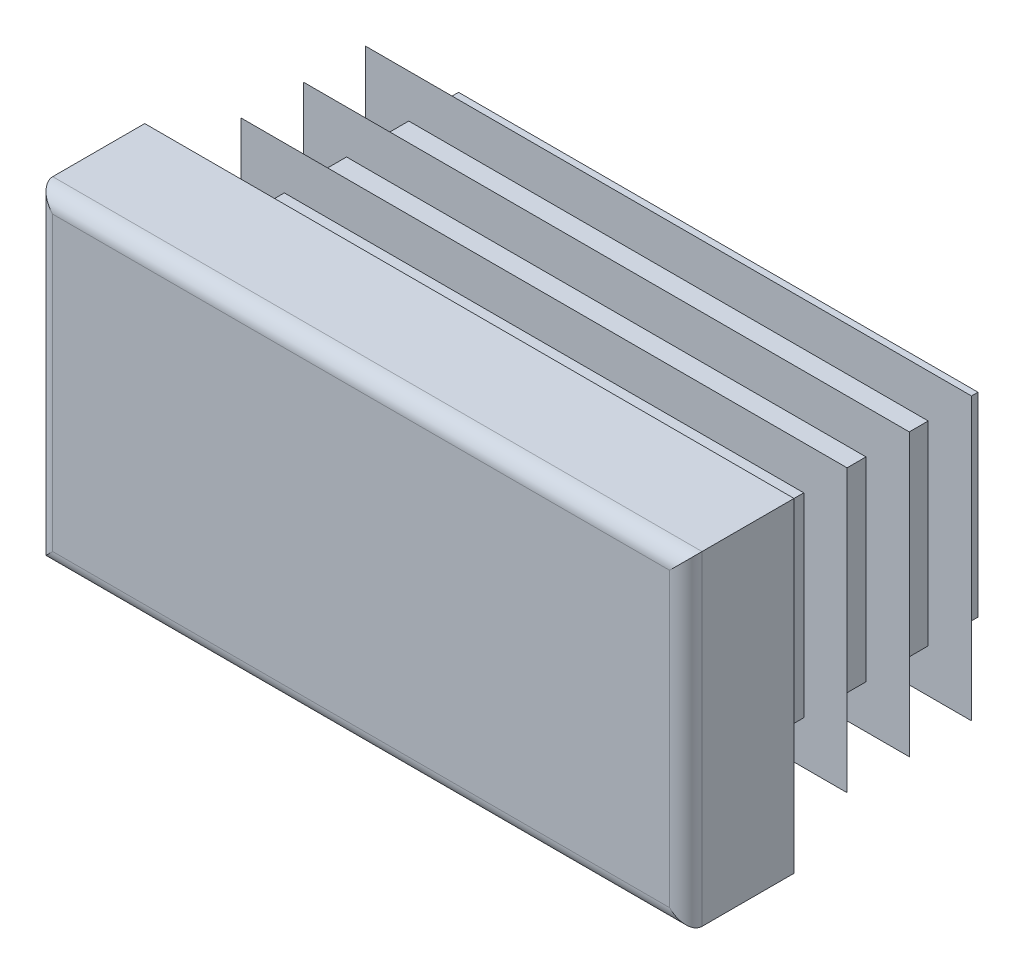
ISO-10303-21;
HEADER;
FILE_DESCRIPTION(('STEP AP214'),'2;1');
FILE_NAME('part.step','',(''),(''),'','','');
FILE_SCHEMA(('AUTOMOTIVE_DESIGN { 1 0 10303 214 1 1 1 1 }'));
ENDSEC;
DATA;
#1=APPLICATION_CONTEXT('core data for automotive mechanical design processes');
#2=APPLICATION_PROTOCOL_DEFINITION('international standard','automotive_design',2000,#1);
#3=PRODUCT_CONTEXT('',#1,'mechanical');
#4=PRODUCT('Part','Part','',(#3));
#5=PRODUCT_RELATED_PRODUCT_CATEGORY('part','',(#4));
#6=PRODUCT_DEFINITION_FORMATION('','',#4);
#7=PRODUCT_DEFINITION_CONTEXT('part definition',#1,'design');
#8=PRODUCT_DEFINITION('design','',#6,#7);
#9=PRODUCT_DEFINITION_SHAPE('','',#8);
#10=(LENGTH_UNIT() NAMED_UNIT(*) SI_UNIT(.MILLI.,.METRE.));
#11=(NAMED_UNIT(*) PLANE_ANGLE_UNIT() SI_UNIT($,.RADIAN.));
#12=(NAMED_UNIT(*) SI_UNIT($,.STERADIAN.) SOLID_ANGLE_UNIT());
#13=UNCERTAINTY_MEASURE_WITH_UNIT(LENGTH_MEASURE(1.E-05),#10,'distance_accuracy_value','');
#14=(GEOMETRIC_REPRESENTATION_CONTEXT(3) GLOBAL_UNCERTAINTY_ASSIGNED_CONTEXT((#13)) GLOBAL_UNIT_ASSIGNED_CONTEXT((#10,
#11,#12)) REPRESENTATION_CONTEXT('',''));
#15=CARTESIAN_POINT('',(0.,0.,0.));
#16=DIRECTION('',(0.,0.,1.));
#17=DIRECTION('',(1.,0.,0.));
#18=AXIS2_PLACEMENT_3D('',#15,#16,#17);
#19=CARTESIAN_POINT('',(14.25,-7.5,5.));
#20=DIRECTION('',(0.,0.,-1.));
#21=DIRECTION('',(0.,1.,0.));
#22=AXIS2_PLACEMENT_3D('',#19,#20,#21);
#23=PLANE('',#22);
#24=DIRECTION('',(0.,1.,0.));
#25=VECTOR('',#24,1.);
#26=CARTESIAN_POINT('',(-14.25,-7.5,5.));
#27=LINE('',#26,#25);
#28=CARTESIAN_POINT('',(-14.25,-6.75,5.));
#29=VERTEX_POINT('',#28);
#30=CARTESIAN_POINT('',(-14.25,6.75,5.));
#31=VERTEX_POINT('',#30);
#32=EDGE_CURVE('E310',#29,#31,#27,.T.);
#33=ORIENTED_EDGE('',*,*,#32,.F.);
#34=DIRECTION('',(-1.,0.,0.));
#35=VECTOR('',#34,1.);
#36=CARTESIAN_POINT('',(15.,-6.75,5.));
#37=LINE('',#36,#35);
#38=CARTESIAN_POINT('',(14.25,-6.75,5.));
#39=VERTEX_POINT('',#38);
#40=EDGE_CURVE('E482',#39,#29,#37,.T.);
#41=ORIENTED_EDGE('',*,*,#40,.F.);
#42=DIRECTION('',(0.,1.,0.));
#43=VECTOR('',#42,1.);
#44=CARTESIAN_POINT('',(14.25,-7.5,5.));
#45=LINE('',#44,#43);
#46=CARTESIAN_POINT('',(14.25,6.75,5.));
#47=VERTEX_POINT('',#46);
#48=EDGE_CURVE('E305',#39,#47,#45,.T.);
#49=ORIENTED_EDGE('',*,*,#48,.T.);
#50=DIRECTION('',(-1.,0.,0.));
#51=VECTOR('',#50,1.);
#52=CARTESIAN_POINT('',(15.,6.75,5.));
#53=LINE('',#52,#51);
#54=EDGE_CURVE('E630',#47,#31,#53,.T.);
#55=ORIENTED_EDGE('',*,*,#54,.T.);
#56=EDGE_LOOP('',(#33,#41,#49,#55));
#57=FACE_BOUND('',#56,.T.);
#58=ADVANCED_FACE('F14',(#57),#23,.F.);
#59=CARTESIAN_POINT('',(-14.25,-7.5,4.25));
#60=DIRECTION('',(0.,1.,0.));
#61=DIRECTION('',(-1.,0.,0.));
#62=AXIS2_PLACEMENT_3D('',#59,#60,#61);
#63=CYLINDRICAL_SURFACE('',#62,0.75);
#64=DIRECTION('',(0.,1.,0.));
#65=VECTOR('',#64,1.);
#66=CARTESIAN_POINT('',(-15.,-7.5,4.25));
#67=LINE('',#66,#65);
#68=CARTESIAN_POINT('',(-15.,-7.5,4.25));
#69=VERTEX_POINT('',#68);
#70=CARTESIAN_POINT('',(-15.,7.5,4.25));
#71=VERTEX_POINT('',#70);
#72=EDGE_CURVE('E402',#69,#71,#67,.T.);
#73=ORIENTED_EDGE('',*,*,#72,.F.);
#74=CARTESIAN_POINT('',(-14.25,-6.75,4.25));
#75=DIRECTION('',(-0.707106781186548,0.707106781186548,0.));
#76=DIRECTION('',(0.707106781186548,0.707106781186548,0.));
#77=AXIS2_PLACEMENT_3D('',#74,#75,#76);
#78=ELLIPSE('',#77,1.06066017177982,0.75);
#79=EDGE_CURVE('E59',#69,#29,#78,.T.);
#80=ORIENTED_EDGE('',*,*,#79,.T.);
#81=ORIENTED_EDGE('',*,*,#32,.T.);
#82=CARTESIAN_POINT('',(-14.25,6.75,4.25));
#83=DIRECTION('',(0.707106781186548,0.707106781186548,0.));
#84=DIRECTION('',(-0.707106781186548,0.707106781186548,0.));
#85=AXIS2_PLACEMENT_3D('',#82,#83,#84);
#86=ELLIPSE('',#85,1.06066017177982,0.75);
#87=EDGE_CURVE('E306',#31,#71,#86,.F.);
#88=ORIENTED_EDGE('',*,*,#87,.T.);
#89=EDGE_LOOP('',(#73,#80,#81,#88));
#90=FACE_BOUND('',#89,.T.);
#91=ADVANCED_FACE('F16',(#90),#63,.T.);
#92=CARTESIAN_POINT('',(-15.,-7.5,4.25));
#93=DIRECTION('',(1.,0.,0.));
#94=DIRECTION('',(0.,1.,0.));
#95=AXIS2_PLACEMENT_3D('',#92,#93,#94);
#96=PLANE('',#95);
#97=DIRECTION('',(0.,0.,-1.));
#98=VECTOR('',#97,1.);
#99=CARTESIAN_POINT('',(-15.,7.5,4.25));
#100=LINE('',#99,#98);
#101=CARTESIAN_POINT('',(-15.,7.5,0.));
#102=VERTEX_POINT('',#101);
#103=EDGE_CURVE('E615',#71,#102,#100,.T.);
#104=ORIENTED_EDGE('',*,*,#103,.T.);
#105=DIRECTION('',(0.,1.,0.));
#106=VECTOR('',#105,1.);
#107=CARTESIAN_POINT('',(-15.,-7.5,0.));
#108=LINE('',#107,#106);
#109=CARTESIAN_POINT('',(-15.,-7.5,0.));
#110=VERTEX_POINT('',#109);
#111=EDGE_CURVE('E400',#110,#102,#108,.T.);
#112=ORIENTED_EDGE('',*,*,#111,.F.);
#113=DIRECTION('',(0.,0.,-1.));
#114=VECTOR('',#113,1.);
#115=CARTESIAN_POINT('',(-15.,-7.5,4.25));
#116=LINE('',#115,#114);
#117=EDGE_CURVE('E616',#69,#110,#116,.T.);
#118=ORIENTED_EDGE('',*,*,#117,.F.);
#119=ORIENTED_EDGE('',*,*,#72,.T.);
#120=EDGE_LOOP('',(#104,#112,#118,#119));
#121=FACE_BOUND('',#120,.T.);
#122=ADVANCED_FACE('F697',(#121),#96,.F.);
#123=CARTESIAN_POINT('',(-12.,-7.5,0.));
#124=DIRECTION('',(1.,0.,0.));
#125=DIRECTION('',(0.,1.,0.));
#126=AXIS2_PLACEMENT_3D('',#123,#124,#125);
#127=PLANE('',#126);
#128=DIRECTION('',(0.,1.,0.));
#129=VECTOR('',#128,1.);
#130=CARTESIAN_POINT('',(-12.,-7.5,0.));
#131=LINE('',#130,#129);
#132=CARTESIAN_POINT('',(-12.,-4.5,0.));
#133=VERTEX_POINT('',#132);
#134=CARTESIAN_POINT('',(-12.,4.5,0.));
#135=VERTEX_POINT('',#134);
#136=EDGE_CURVE('E397',#133,#135,#131,.T.);
#137=ORIENTED_EDGE('',*,*,#136,.T.);
#138=DIRECTION('',(0.,0.,-1.));
#139=VECTOR('',#138,1.);
#140=CARTESIAN_POINT('',(-12.,4.5,0.));
#141=LINE('',#140,#139);
#142=CARTESIAN_POINT('',(-12.,4.5,-0.575));
#143=VERTEX_POINT('',#142);
#144=EDGE_CURVE('E495',#135,#143,#141,.T.);
#145=ORIENTED_EDGE('',*,*,#144,.T.);
#146=DIRECTION('',(0.,1.,0.));
#147=VECTOR('',#146,1.);
#148=CARTESIAN_POINT('',(-12.,-7.5,-0.575));
#149=LINE('',#148,#147);
#150=CARTESIAN_POINT('',(-12.,-4.5,-0.575));
#151=VERTEX_POINT('',#150);
#152=EDGE_CURVE('E394',#151,#143,#149,.T.);
#153=ORIENTED_EDGE('',*,*,#152,.F.);
#154=DIRECTION('',(0.,0.,1.));
#155=VECTOR('',#154,1.);
#156=CARTESIAN_POINT('',(-12.,-4.5,0.));
#157=LINE('',#156,#155);
#158=EDGE_CURVE('E489',#151,#133,#157,.T.);
#159=ORIENTED_EDGE('',*,*,#158,.T.);
#160=EDGE_LOOP('',(#137,#145,#153,#159));
#161=FACE_BOUND('',#160,.T.);
#162=ADVANCED_FACE('F787',(#161),#127,.F.);
#163=CARTESIAN_POINT('',(-14.,-7.5,-0.575));
#164=DIRECTION('',(0.342020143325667,0.,0.939692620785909));
#165=DIRECTION('',(-0.939692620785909,0.,0.342020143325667));
#166=AXIS2_PLACEMENT_3D('',#163,#164,#165);
#167=PLANE('',#166);
#168=DIRECTION('',(0.,1.,0.));
#169=VECTOR('',#168,1.);
#170=CARTESIAN_POINT('',(-14.,-7.5,-0.575));
#171=LINE('',#170,#169);
#172=CARTESIAN_POINT('',(-14.,-6.5,-0.575));
#173=VERTEX_POINT('',#172);
#174=CARTESIAN_POINT('',(-14.,6.5,-0.575));
#175=VERTEX_POINT('',#174);
#176=EDGE_CURVE('E392',#173,#175,#171,.T.);
#177=ORIENTED_EDGE('',*,*,#176,.T.);
#178=DIRECTION('',(0.844349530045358,-0.43889572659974,-0.307318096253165));
#179=VECTOR('',#178,1.);
#180=CARTESIAN_POINT('',(-8.81186039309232,3.80318757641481,-2.46332838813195));
#181=LINE('',#180,#179);
#182=CARTESIAN_POINT('',(-12.,5.46039327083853,-1.3029404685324));
#183=VERTEX_POINT('',#182);
#184=EDGE_CURVE('E519',#175,#183,#181,.T.);
#185=ORIENTED_EDGE('',*,*,#184,.T.);
#186=DIRECTION('',(0.,1.,0.));
#187=VECTOR('',#186,1.);
#188=CARTESIAN_POINT('',(-12.,-7.5,-1.3029404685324));
#189=LINE('',#188,#187);
#190=CARTESIAN_POINT('',(-12.,-5.46039327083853,-1.3029404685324));
#191=VERTEX_POINT('',#190);
#192=EDGE_CURVE('E389',#191,#183,#189,.T.);
#193=ORIENTED_EDGE('',*,*,#192,.F.);
#194=DIRECTION('',(-0.844349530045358,-0.438895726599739,0.307318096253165));
#195=VECTOR('',#194,1.);
#196=CARTESIAN_POINT('',(-14.3705814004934,-6.69262945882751,-0.440119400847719));
#197=LINE('',#196,#195);
#198=EDGE_CURVE('E507',#191,#173,#197,.T.);
#199=ORIENTED_EDGE('',*,*,#198,.T.);
#200=EDGE_LOOP('',(#177,#185,#193,#199));
#201=FACE_BOUND('',#200,.T.);
#202=ADVANCED_FACE('F783',(#201),#167,.F.);
#203=CARTESIAN_POINT('',(-12.,-7.5,-1.3029404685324));
#204=DIRECTION('',(1.,0.,0.));
#205=DIRECTION('',(0.,1.,0.));
#206=AXIS2_PLACEMENT_3D('',#203,#204,#205);
#207=PLANE('',#206);
#208=ORIENTED_EDGE('',*,*,#192,.T.);
#209=DIRECTION('',(0.,-0.819152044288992,-0.573576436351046));
#210=VECTOR('',#209,1.);
#211=CARTESIAN_POINT('',(-12.,-3.23616114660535,-7.39233342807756));
#212=LINE('',#211,#210);
#213=CARTESIAN_POINT('',(-12.,4.5,-1.97541507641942));
#214=VERTEX_POINT('',#213);
#215=EDGE_CURVE('E516',#183,#214,#212,.T.);
#216=ORIENTED_EDGE('',*,*,#215,.T.);
#217=DIRECTION('',(0.,0.,-1.));
#218=VECTOR('',#217,1.);
#219=CARTESIAN_POINT('',(-12.,4.5,-1.3029404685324));
#220=LINE('',#219,#218);
#221=CARTESIAN_POINT('',(-12.,4.5,-3.45));
#222=VERTEX_POINT('',#221);
#223=EDGE_CURVE('E525',#214,#222,#220,.T.);
#224=ORIENTED_EDGE('',*,*,#223,.T.);
#225=DIRECTION('',(0.,1.,0.));
#226=VECTOR('',#225,1.);
#227=CARTESIAN_POINT('',(-12.,-7.5,-3.45));
#228=LINE('',#227,#226);
#229=CARTESIAN_POINT('',(-12.,-4.5,-3.45));
#230=VERTEX_POINT('',#229);
#231=EDGE_CURVE('E386',#230,#222,#228,.T.);
#232=ORIENTED_EDGE('',*,*,#231,.F.);
#233=DIRECTION('',(0.,0.,1.));
#234=VECTOR('',#233,1.);
#235=CARTESIAN_POINT('',(-12.,-4.5,-1.3029404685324));
#236=LINE('',#235,#234);
#237=CARTESIAN_POINT('',(-12.,-4.5,-1.97541507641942));
#238=VERTEX_POINT('',#237);
#239=EDGE_CURVE('E522',#230,#238,#236,.T.);
#240=ORIENTED_EDGE('',*,*,#239,.T.);
#241=DIRECTION('',(0.,-0.819152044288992,0.573576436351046));
#242=VECTOR('',#241,1.);
#243=CARTESIAN_POINT('',(-12.,-6.82898992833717,-0.344638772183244));
#244=LINE('',#243,#242);
#245=EDGE_CURVE('E504',#238,#191,#244,.T.);
#246=ORIENTED_EDGE('',*,*,#245,.T.);
#247=EDGE_LOOP('',(#208,#216,#224,#232,#240,#246));
#248=FACE_BOUND('',#247,.T.);
#249=ADVANCED_FACE('F779',(#248),#207,.F.);
#250=CARTESIAN_POINT('',(-14.,-7.5,-3.45));
#251=DIRECTION('',(0.342020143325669,0.,0.939692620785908));
#252=DIRECTION('',(-0.939692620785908,0.,0.342020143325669));
#253=AXIS2_PLACEMENT_3D('',#250,#251,#252);
#254=PLANE('',#253);
#255=DIRECTION('',(0.,1.,0.));
#256=VECTOR('',#255,1.);
#257=CARTESIAN_POINT('',(-14.,-7.5,-3.45));
#258=LINE('',#257,#256);
#259=CARTESIAN_POINT('',(-14.,-6.5,-3.45));
#260=VERTEX_POINT('',#259);
#261=CARTESIAN_POINT('',(-14.,6.5,-3.45));
#262=VERTEX_POINT('',#261);
#263=EDGE_CURVE('E384',#260,#262,#258,.T.);
#264=ORIENTED_EDGE('',*,*,#263,.T.);
#265=DIRECTION('',(0.844349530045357,-0.438895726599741,-0.307318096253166));
#266=VECTOR('',#265,1.);
#267=CARTESIAN_POINT('',(-8.8118603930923,3.80318757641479,-5.33832838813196));
#268=LINE('',#267,#266);
#269=CARTESIAN_POINT('',(-12.,5.46039327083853,-4.1779404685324));
#270=VERTEX_POINT('',#269);
#271=EDGE_CURVE('E549',#262,#270,#268,.T.);
#272=ORIENTED_EDGE('',*,*,#271,.T.);
#273=DIRECTION('',(0.,1.,0.));
#274=VECTOR('',#273,1.);
#275=CARTESIAN_POINT('',(-12.,-7.5,-4.1779404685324));
#276=LINE('',#275,#274);
#277=CARTESIAN_POINT('',(-12.,-5.46039327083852,-4.1779404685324));
#278=VERTEX_POINT('',#277);
#279=EDGE_CURVE('E381',#278,#270,#276,.T.);
#280=ORIENTED_EDGE('',*,*,#279,.F.);
#281=DIRECTION('',(-0.844349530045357,-0.438895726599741,0.307318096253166));
#282=VECTOR('',#281,1.);
#283=CARTESIAN_POINT('',(-14.3705814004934,-6.69262945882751,-3.31511940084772));
#284=LINE('',#283,#282);
#285=EDGE_CURVE('E537',#278,#260,#284,.T.);
#286=ORIENTED_EDGE('',*,*,#285,.T.);
#287=EDGE_LOOP('',(#264,#272,#280,#286));
#288=FACE_BOUND('',#287,.T.);
#289=ADVANCED_FACE('F775',(#288),#254,.F.);
#290=CARTESIAN_POINT('',(-12.,-7.5,-4.1779404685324));
#291=DIRECTION('',(1.,0.,0.));
#292=DIRECTION('',(0.,1.,0.));
#293=AXIS2_PLACEMENT_3D('',#290,#291,#292);
#294=PLANE('',#293);
#295=ORIENTED_EDGE('',*,*,#279,.T.);
#296=DIRECTION('',(0.,-0.819152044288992,-0.573576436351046));
#297=VECTOR('',#296,1.);
#298=CARTESIAN_POINT('',(-12.,-3.23616114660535,-10.2673334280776));
#299=LINE('',#298,#297);
#300=CARTESIAN_POINT('',(-12.,4.5,-4.85041507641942));
#301=VERTEX_POINT('',#300);
#302=EDGE_CURVE('E546',#270,#301,#299,.T.);
#303=ORIENTED_EDGE('',*,*,#302,.T.);
#304=DIRECTION('',(0.,0.,-1.));
#305=VECTOR('',#304,1.);
#306=CARTESIAN_POINT('',(-12.,4.5,-4.1779404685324));
#307=LINE('',#306,#305);
#308=CARTESIAN_POINT('',(-12.,4.5,-6.325));
#309=VERTEX_POINT('',#308);
#310=EDGE_CURVE('E555',#301,#309,#307,.T.);
#311=ORIENTED_EDGE('',*,*,#310,.T.);
#312=DIRECTION('',(0.,1.,0.));
#313=VECTOR('',#312,1.);
#314=CARTESIAN_POINT('',(-12.,-7.5,-6.325));
#315=LINE('',#314,#313);
#316=CARTESIAN_POINT('',(-12.,-4.5,-6.325));
#317=VERTEX_POINT('',#316);
#318=EDGE_CURVE('E378',#317,#309,#315,.T.);
#319=ORIENTED_EDGE('',*,*,#318,.F.);
#320=DIRECTION('',(0.,0.,1.));
#321=VECTOR('',#320,1.);
#322=CARTESIAN_POINT('',(-12.,-4.5,-4.1779404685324));
#323=LINE('',#322,#321);
#324=CARTESIAN_POINT('',(-12.,-4.5,-4.85041507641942));
#325=VERTEX_POINT('',#324);
#326=EDGE_CURVE('E552',#317,#325,#323,.T.);
#327=ORIENTED_EDGE('',*,*,#326,.T.);
#328=DIRECTION('',(0.,-0.819152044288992,0.573576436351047));
#329=VECTOR('',#328,1.);
#330=CARTESIAN_POINT('',(-12.,-6.82898992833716,-3.21963877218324));
#331=LINE('',#330,#329);
#332=EDGE_CURVE('E534',#325,#278,#331,.T.);
#333=ORIENTED_EDGE('',*,*,#332,.T.);
#334=EDGE_LOOP('',(#295,#303,#311,#319,#327,#333));
#335=FACE_BOUND('',#334,.T.);
#336=ADVANCED_FACE('F771',(#335),#294,.F.);
#337=CARTESIAN_POINT('',(-14.,-7.5,-6.325));
#338=DIRECTION('',(0.342020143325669,0.,0.939692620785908));
#339=DIRECTION('',(-0.939692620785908,0.,0.342020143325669));
#340=AXIS2_PLACEMENT_3D('',#337,#338,#339);
#341=PLANE('',#340);
#342=DIRECTION('',(0.,1.,0.));
#343=VECTOR('',#342,1.);
#344=CARTESIAN_POINT('',(-14.,-7.5,-6.325));
#345=LINE('',#344,#343);
#346=CARTESIAN_POINT('',(-14.,-6.5,-6.325));
#347=VERTEX_POINT('',#346);
#348=CARTESIAN_POINT('',(-14.,6.5,-6.325));
#349=VERTEX_POINT('',#348);
#350=EDGE_CURVE('E376',#347,#349,#345,.T.);
#351=ORIENTED_EDGE('',*,*,#350,.T.);
#352=DIRECTION('',(0.844349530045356,-0.438895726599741,-0.307318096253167));
#353=VECTOR('',#352,1.);
#354=CARTESIAN_POINT('',(-8.8118603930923,3.80318757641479,-8.21332838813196));
#355=LINE('',#354,#353);
#356=CARTESIAN_POINT('',(-12.,5.46039327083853,-7.05294046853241));
#357=VERTEX_POINT('',#356);
#358=EDGE_CURVE('E579',#349,#357,#355,.T.);
#359=ORIENTED_EDGE('',*,*,#358,.T.);
#360=DIRECTION('',(0.,1.,0.));
#361=VECTOR('',#360,1.);
#362=CARTESIAN_POINT('',(-12.,-7.5,-7.05294046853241));
#363=LINE('',#362,#361);
#364=CARTESIAN_POINT('',(-12.,-5.46039327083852,-7.05294046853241));
#365=VERTEX_POINT('',#364);
#366=EDGE_CURVE('E373',#365,#357,#363,.T.);
#367=ORIENTED_EDGE('',*,*,#366,.F.);
#368=DIRECTION('',(-0.844349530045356,-0.438895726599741,0.307318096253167));
#369=VECTOR('',#368,1.);
#370=CARTESIAN_POINT('',(-14.3705814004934,-6.69262945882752,-6.19011940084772));
#371=LINE('',#370,#369);
#372=EDGE_CURVE('E567',#365,#347,#371,.T.);
#373=ORIENTED_EDGE('',*,*,#372,.T.);
#374=EDGE_LOOP('',(#351,#359,#367,#373));
#375=FACE_BOUND('',#374,.T.);
#376=ADVANCED_FACE('F767',(#375),#341,.F.);
#377=CARTESIAN_POINT('',(-12.,-7.5,-7.05294046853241));
#378=DIRECTION('',(1.,0.,0.));
#379=DIRECTION('',(0.,1.,0.));
#380=AXIS2_PLACEMENT_3D('',#377,#378,#379);
#381=PLANE('',#380);
#382=ORIENTED_EDGE('',*,*,#366,.T.);
#383=DIRECTION('',(0.,-0.819152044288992,-0.573576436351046));
#384=VECTOR('',#383,1.);
#385=CARTESIAN_POINT('',(-12.,-3.23616114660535,-13.1423334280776));
#386=LINE('',#385,#384);
#387=CARTESIAN_POINT('',(-12.,4.5,-7.72541507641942));
#388=VERTEX_POINT('',#387);
#389=EDGE_CURVE('E576',#357,#388,#386,.T.);
#390=ORIENTED_EDGE('',*,*,#389,.T.);
#391=DIRECTION('',(0.,0.,-1.));
#392=VECTOR('',#391,1.);
#393=CARTESIAN_POINT('',(-12.,4.5,-7.05294046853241));
#394=LINE('',#393,#392);
#395=CARTESIAN_POINT('',(-12.,4.5,-9.2));
#396=VERTEX_POINT('',#395);
#397=EDGE_CURVE('E585',#388,#396,#394,.T.);
#398=ORIENTED_EDGE('',*,*,#397,.T.);
#399=DIRECTION('',(0.,1.,0.));
#400=VECTOR('',#399,1.);
#401=CARTESIAN_POINT('',(-12.,-7.5,-9.2));
#402=LINE('',#401,#400);
#403=CARTESIAN_POINT('',(-12.,-4.5,-9.2));
#404=VERTEX_POINT('',#403);
#405=EDGE_CURVE('E370',#404,#396,#402,.T.);
#406=ORIENTED_EDGE('',*,*,#405,.F.);
#407=DIRECTION('',(0.,0.,1.));
#408=VECTOR('',#407,1.);
#409=CARTESIAN_POINT('',(-12.,-4.5,-7.05294046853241));
#410=LINE('',#409,#408);
#411=CARTESIAN_POINT('',(-12.,-4.5,-7.72541507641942));
#412=VERTEX_POINT('',#411);
#413=EDGE_CURVE('E582',#404,#412,#410,.T.);
#414=ORIENTED_EDGE('',*,*,#413,.T.);
#415=DIRECTION('',(0.,-0.819152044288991,0.573576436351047));
#416=VECTOR('',#415,1.);
#417=CARTESIAN_POINT('',(-12.,-6.82898992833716,-6.09463877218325));
#418=LINE('',#417,#416);
#419=EDGE_CURVE('E564',#412,#365,#418,.T.);
#420=ORIENTED_EDGE('',*,*,#419,.T.);
#421=EDGE_LOOP('',(#382,#390,#398,#406,#414,#420));
#422=FACE_BOUND('',#421,.T.);
#423=ADVANCED_FACE('F764',(#422),#381,.F.);
#424=CARTESIAN_POINT('',(-14.,-7.5,-9.2));
#425=DIRECTION('',(0.342020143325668,0.,0.939692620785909));
#426=DIRECTION('',(-0.939692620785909,0.,0.342020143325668));
#427=AXIS2_PLACEMENT_3D('',#424,#425,#426);
#428=PLANE('',#427);
#429=DIRECTION('',(0.,1.,0.));
#430=VECTOR('',#429,1.);
#431=CARTESIAN_POINT('',(-14.,-7.5,-9.2));
#432=LINE('',#431,#430);
#433=CARTESIAN_POINT('',(-14.,-6.5,-9.2));
#434=VERTEX_POINT('',#433);
#435=CARTESIAN_POINT('',(-14.,6.5,-9.2));
#436=VERTEX_POINT('',#435);
#437=EDGE_CURVE('E368',#434,#436,#432,.T.);
#438=ORIENTED_EDGE('',*,*,#437,.T.);
#439=DIRECTION('',(0.844349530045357,-0.43889572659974,-0.307318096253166));
#440=VECTOR('',#439,1.);
#441=CARTESIAN_POINT('',(-8.81186039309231,3.8031875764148,-11.0883283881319));
#442=LINE('',#441,#440);
#443=CARTESIAN_POINT('',(-12.,5.46039327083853,-9.9279404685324));
#444=VERTEX_POINT('',#443);
#445=EDGE_CURVE('E607',#436,#444,#442,.T.);
#446=ORIENTED_EDGE('',*,*,#445,.T.);
#447=DIRECTION('',(0.,1.,0.));
#448=VECTOR('',#447,1.);
#449=CARTESIAN_POINT('',(-12.,-7.5,-9.9279404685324));
#450=LINE('',#449,#448);
#451=CARTESIAN_POINT('',(-12.,-5.46039327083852,-9.9279404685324));
#452=VERTEX_POINT('',#451);
#453=EDGE_CURVE('E365',#452,#444,#450,.T.);
#454=ORIENTED_EDGE('',*,*,#453,.F.);
#455=DIRECTION('',(-0.844349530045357,-0.438895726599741,0.307318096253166));
#456=VECTOR('',#455,1.);
#457=CARTESIAN_POINT('',(-14.3705814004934,-6.69262945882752,-9.06511940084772));
#458=LINE('',#457,#456);
#459=EDGE_CURVE('E595',#452,#434,#458,.T.);
#460=ORIENTED_EDGE('',*,*,#459,.T.);
#461=EDGE_LOOP('',(#438,#446,#454,#460));
#462=FACE_BOUND('',#461,.T.);
#463=ADVANCED_FACE('F675',(#462),#428,.F.);
#464=CARTESIAN_POINT('',(-12.,-7.5,-9.9279404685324));
#465=DIRECTION('',(1.,0.,0.));
#466=DIRECTION('',(0.,1.,0.));
#467=AXIS2_PLACEMENT_3D('',#464,#465,#466);
#468=PLANE('',#467);
#469=ORIENTED_EDGE('',*,*,#453,.T.);
#470=DIRECTION('',(0.,-0.819152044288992,-0.573576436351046));
#471=VECTOR('',#470,1.);
#472=CARTESIAN_POINT('',(-12.,-3.23616114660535,-16.0173334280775));
#473=LINE('',#472,#471);
#474=CARTESIAN_POINT('',(-12.,4.5,-10.6004150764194));
#475=VERTEX_POINT('',#474);
#476=EDGE_CURVE('E604',#444,#475,#473,.T.);
#477=ORIENTED_EDGE('',*,*,#476,.T.);
#478=DIRECTION('',(0.,0.,-1.));
#479=VECTOR('',#478,1.);
#480=CARTESIAN_POINT('',(-12.,4.5,-9.9279404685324));
#481=LINE('',#480,#479);
#482=CARTESIAN_POINT('',(-12.,4.5,-11.5));
#483=VERTEX_POINT('',#482);
#484=EDGE_CURVE('E613',#475,#483,#481,.T.);
#485=ORIENTED_EDGE('',*,*,#484,.T.);
#486=DIRECTION('',(0.,1.,0.));
#487=VECTOR('',#486,1.);
#488=CARTESIAN_POINT('',(-12.,-7.5,-11.5));
#489=LINE('',#488,#487);
#490=CARTESIAN_POINT('',(-12.,-4.5,-11.5));
#491=VERTEX_POINT('',#490);
#492=EDGE_CURVE('E362',#491,#483,#489,.T.);
#493=ORIENTED_EDGE('',*,*,#492,.F.);
#494=DIRECTION('',(0.,0.,1.));
#495=VECTOR('',#494,1.);
#496=CARTESIAN_POINT('',(-12.,-4.5,-9.9279404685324));
#497=LINE('',#496,#495);
#498=CARTESIAN_POINT('',(-12.,-4.5,-10.6004150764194));
#499=VERTEX_POINT('',#498);
#500=EDGE_CURVE('E610',#491,#499,#497,.T.);
#501=ORIENTED_EDGE('',*,*,#500,.T.);
#502=DIRECTION('',(0.,-0.819152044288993,0.573576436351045));
#503=VECTOR('',#502,1.);
#504=CARTESIAN_POINT('',(-12.,-6.82898992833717,-8.96963877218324));
#505=LINE('',#504,#503);
#506=EDGE_CURVE('E592',#499,#452,#505,.T.);
#507=ORIENTED_EDGE('',*,*,#506,.T.);
#508=EDGE_LOOP('',(#469,#477,#485,#493,#501,#507));
#509=FACE_BOUND('',#508,.T.);
#510=ADVANCED_FACE('F677',(#509),#468,.F.);
#511=CARTESIAN_POINT('',(-12.,-7.5,-11.5));
#512=DIRECTION('',(0.,0.,1.));
#513=DIRECTION('',(0.,-1.,0.));
#514=AXIS2_PLACEMENT_3D('',#511,#512,#513);
#515=PLANE('',#514);
#516=ORIENTED_EDGE('',*,*,#492,.T.);
#517=DIRECTION('',(-1.,0.,0.));
#518=VECTOR('',#517,1.);
#519=CARTESIAN_POINT('',(15.,4.5,-11.5));
#520=LINE('',#519,#518);
#521=CARTESIAN_POINT('',(12.,4.5,-11.5));
#522=VERTEX_POINT('',#521);
#523=EDGE_CURVE('E438',#522,#483,#520,.T.);
#524=ORIENTED_EDGE('',*,*,#523,.F.);
#525=DIRECTION('',(0.,1.,0.));
#526=VECTOR('',#525,1.);
#527=CARTESIAN_POINT('',(12.,-7.5,-11.5));
#528=LINE('',#527,#526);
#529=CARTESIAN_POINT('',(12.,-4.5,-11.5));
#530=VERTEX_POINT('',#529);
#531=EDGE_CURVE('E359',#530,#522,#528,.T.);
#532=ORIENTED_EDGE('',*,*,#531,.F.);
#533=DIRECTION('',(-1.,0.,0.));
#534=VECTOR('',#533,1.);
#535=CARTESIAN_POINT('',(15.,-4.5,-11.5));
#536=LINE('',#535,#534);
#537=EDGE_CURVE('E436',#530,#491,#536,.T.);
#538=ORIENTED_EDGE('',*,*,#537,.T.);
#539=EDGE_LOOP('',(#516,#524,#532,#538));
#540=FACE_BOUND('',#539,.T.);
#541=ADVANCED_FACE('F435',(#540),#515,.F.);
#542=CARTESIAN_POINT('',(12.,-7.5,-11.5));
#543=DIRECTION('',(-1.,0.,0.));
#544=DIRECTION('',(0.,-1.,0.));
#545=AXIS2_PLACEMENT_3D('',#542,#543,#544);
#546=PLANE('',#545);
#547=DIRECTION('',(0.,0.,1.));
#548=VECTOR('',#547,1.);
#549=CARTESIAN_POINT('',(12.,4.5,-11.5));
#550=LINE('',#549,#548);
#551=CARTESIAN_POINT('',(12.,4.5,-10.6004150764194));
#552=VERTEX_POINT('',#551);
#553=EDGE_CURVE('E9',#522,#552,#550,.T.);
#554=ORIENTED_EDGE('',*,*,#553,.T.);
#555=DIRECTION('',(0.,0.819152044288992,0.573576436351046));
#556=VECTOR('',#555,1.);
#557=CARTESIAN_POINT('',(12.,-3.97478751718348,-16.5345251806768));
#558=LINE('',#557,#556);
#559=CARTESIAN_POINT('',(12.,5.46039327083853,-9.9279404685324));
#560=VERTEX_POINT('',#559);
#561=EDGE_CURVE('E601',#552,#560,#558,.T.);
#562=ORIENTED_EDGE('',*,*,#561,.T.);
#563=DIRECTION('',(0.,1.,0.));
#564=VECTOR('',#563,1.);
#565=CARTESIAN_POINT('',(12.,-7.5,-9.9279404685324));
#566=LINE('',#565,#564);
#567=CARTESIAN_POINT('',(12.,-5.46039327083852,-9.9279404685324));
#568=VERTEX_POINT('',#567);
#569=EDGE_CURVE('E356',#568,#560,#566,.T.);
#570=ORIENTED_EDGE('',*,*,#569,.F.);
#571=DIRECTION('',(0.,0.819152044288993,-0.573576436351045));
#572=VECTOR('',#571,1.);
#573=CARTESIAN_POINT('',(12.,-6.09036355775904,-9.48683052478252));
#574=LINE('',#573,#572);
#575=CARTESIAN_POINT('',(12.,-4.5,-10.6004150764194));
#576=VERTEX_POINT('',#575);
#577=EDGE_CURVE('E428',#568,#576,#574,.T.);
#578=ORIENTED_EDGE('',*,*,#577,.T.);
#579=DIRECTION('',(0.,0.,-1.));
#580=VECTOR('',#579,1.);
#581=CARTESIAN_POINT('',(12.,-4.5,-11.5));
#582=LINE('',#581,#580);
#583=EDGE_CURVE('E23',#576,#530,#582,.T.);
#584=ORIENTED_EDGE('',*,*,#583,.T.);
#585=ORIENTED_EDGE('',*,*,#531,.T.);
#586=EDGE_LOOP('',(#554,#562,#570,#578,#584,#585));
#587=FACE_BOUND('',#586,.T.);
#588=ADVANCED_FACE('F426',(#587),#546,.F.);
#589=CARTESIAN_POINT('',(12.,-7.5,-9.9279404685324));
#590=DIRECTION('',(-0.342020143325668,0.,0.939692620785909));
#591=DIRECTION('',(-0.939692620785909,0.,-0.342020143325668));
#592=AXIS2_PLACEMENT_3D('',#589,#590,#591);
#593=PLANE('',#592);
#594=ORIENTED_EDGE('',*,*,#569,.T.);
#595=DIRECTION('',(0.844349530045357,0.43889572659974,0.307318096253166));
#596=VECTOR('',#595,1.);
#597=CARTESIAN_POINT('',(7.19711931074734,2.96383972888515,-11.6760460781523));
#598=LINE('',#597,#596);
#599=CARTESIAN_POINT('',(14.,6.5,-9.2));
#600=VERTEX_POINT('',#599);
#601=EDGE_CURVE('E598',#560,#600,#598,.T.);
#602=ORIENTED_EDGE('',*,*,#601,.T.);
#603=DIRECTION('',(0.,1.,0.));
#604=VECTOR('',#603,1.);
#605=CARTESIAN_POINT('',(14.,-7.5,-9.2));
#606=LINE('',#605,#604);
#607=CARTESIAN_POINT('',(14.,-6.5,-9.2));
#608=VERTEX_POINT('',#607);
#609=EDGE_CURVE('E353',#608,#600,#606,.T.);
#610=ORIENTED_EDGE('',*,*,#609,.F.);
#611=DIRECTION('',(-0.844349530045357,0.438895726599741,-0.307318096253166));
#612=VECTOR('',#611,1.);
#613=CARTESIAN_POINT('',(12.7558403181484,-5.85328161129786,-9.65283709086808));
#614=LINE('',#613,#612);
#615=EDGE_CURVE('E588',#608,#568,#614,.T.);
#616=ORIENTED_EDGE('',*,*,#615,.T.);
#617=EDGE_LOOP('',(#594,#602,#610,#616));
#618=FACE_BOUND('',#617,.T.);
#619=ADVANCED_FACE('F752',(#618),#593,.F.);
#620=CARTESIAN_POINT('',(14.,-7.5,-9.2));
#621=DIRECTION('',(0.,0.,-1.));
#622=DIRECTION('',(0.,1.,0.));
#623=AXIS2_PLACEMENT_3D('',#620,#621,#622);
#624=PLANE('',#623);
#625=ORIENTED_EDGE('',*,*,#609,.T.);
#626=DIRECTION('',(-1.,0.,0.));
#627=VECTOR('',#626,1.);
#628=CARTESIAN_POINT('',(15.,6.5,-9.2));
#629=LINE('',#628,#627);
#630=EDGE_CURVE('E444',#600,#436,#629,.T.);
#631=ORIENTED_EDGE('',*,*,#630,.T.);
#632=ORIENTED_EDGE('',*,*,#437,.F.);
#633=DIRECTION('',(-1.,0.,0.));
#634=VECTOR('',#633,1.);
#635=CARTESIAN_POINT('',(15.,-6.5,-9.2));
#636=LINE('',#635,#634);
#637=EDGE_CURVE('E451',#608,#434,#636,.T.);
#638=ORIENTED_EDGE('',*,*,#637,.F.);
#639=EDGE_LOOP('',(#625,#631,#632,#638));
#640=FACE_BOUND('',#639,.T.);
#641=ORIENTED_EDGE('',*,*,#405,.T.);
#642=DIRECTION('',(-1.,0.,0.));
#643=VECTOR('',#642,1.);
#644=CARTESIAN_POINT('',(15.,4.5,-9.2));
#645=LINE('',#644,#643);
#646=CARTESIAN_POINT('',(12.,4.5,-9.2));
#647=VERTEX_POINT('',#646);
#648=EDGE_CURVE('E663',#647,#396,#645,.T.);
#649=ORIENTED_EDGE('',*,*,#648,.F.);
#650=DIRECTION('',(0.,1.,0.));
#651=VECTOR('',#650,1.);
#652=CARTESIAN_POINT('',(12.,-7.5,-9.2));
#653=LINE('',#652,#651);
#654=CARTESIAN_POINT('',(12.,-4.5,-9.2));
#655=VERTEX_POINT('',#654);
#656=EDGE_CURVE('E350',#655,#647,#653,.T.);
#657=ORIENTED_EDGE('',*,*,#656,.F.);
#658=DIRECTION('',(-1.,0.,0.));
#659=VECTOR('',#658,1.);
#660=CARTESIAN_POINT('',(15.,-4.5,-9.2));
#661=LINE('',#660,#659);
#662=EDGE_CURVE('E453',#655,#404,#661,.T.);
#663=ORIENTED_EDGE('',*,*,#662,.T.);
#664=EDGE_LOOP('',(#641,#649,#657,#663));
#665=FACE_BOUND('',#664,.T.);
#666=ADVANCED_FACE('F667',(#640,#665),#624,.F.);
#667=CARTESIAN_POINT('',(12.,-7.5,-9.2));
#668=DIRECTION('',(-1.,0.,0.));
#669=DIRECTION('',(0.,-1.,0.));
#670=AXIS2_PLACEMENT_3D('',#667,#668,#669);
#671=PLANE('',#670);
#672=DIRECTION('',(0.,0.,1.));
#673=VECTOR('',#672,1.);
#674=CARTESIAN_POINT('',(12.,4.5,-9.2));
#675=LINE('',#674,#673);
#676=CARTESIAN_POINT('',(12.,4.5,-7.72541507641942));
#677=VERTEX_POINT('',#676);
#678=EDGE_CURVE('E420',#647,#677,#675,.T.);
#679=ORIENTED_EDGE('',*,*,#678,.T.);
#680=DIRECTION('',(0.,0.819152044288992,0.573576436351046));
#681=VECTOR('',#680,1.);
#682=CARTESIAN_POINT('',(12.,-4.24494914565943,-13.8486943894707));
#683=LINE('',#682,#681);
#684=CARTESIAN_POINT('',(12.,5.46039327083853,-7.05294046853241));
#685=VERTEX_POINT('',#684);
#686=EDGE_CURVE('E573',#677,#685,#683,.T.);
#687=ORIENTED_EDGE('',*,*,#686,.T.);
#688=DIRECTION('',(0.,1.,0.));
#689=VECTOR('',#688,1.);
#690=CARTESIAN_POINT('',(12.,-7.5,-7.05294046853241));
#691=LINE('',#690,#689);
#692=CARTESIAN_POINT('',(12.,-5.46039327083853,-7.05294046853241));
#693=VERTEX_POINT('',#692);
#694=EDGE_CURVE('E347',#693,#685,#691,.T.);
#695=ORIENTED_EDGE('',*,*,#694,.F.);
#696=DIRECTION('',(0.,0.819152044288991,-0.573576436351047));
#697=VECTOR('',#696,1.);
#698=CARTESIAN_POINT('',(12.,-5.82020192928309,-6.8009997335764));
#699=LINE('',#698,#697);
#700=CARTESIAN_POINT('',(12.,-4.5,-7.72541507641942));
#701=VERTEX_POINT('',#700);
#702=EDGE_CURVE('E561',#693,#701,#699,.T.);
#703=ORIENTED_EDGE('',*,*,#702,.T.);
#704=DIRECTION('',(0.,0.,-1.));
#705=VECTOR('',#704,1.);
#706=CARTESIAN_POINT('',(12.,-4.5,-9.2));
#707=LINE('',#706,#705);
#708=EDGE_CURVE('E417',#701,#655,#707,.T.);
#709=ORIENTED_EDGE('',*,*,#708,.T.);
#710=ORIENTED_EDGE('',*,*,#656,.T.);
#711=EDGE_LOOP('',(#679,#687,#695,#703,#709,#710));
#712=FACE_BOUND('',#711,.T.);
#713=ADVANCED_FACE('F745',(#712),#671,.F.);
#714=CARTESIAN_POINT('',(12.,-7.5,-7.05294046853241));
#715=DIRECTION('',(-0.342020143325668,0.,0.939692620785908));
#716=DIRECTION('',(-0.939692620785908,0.,-0.342020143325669));
#717=AXIS2_PLACEMENT_3D('',#714,#715,#716);
#718=PLANE('',#717);
#719=ORIENTED_EDGE('',*,*,#694,.T.);
#720=DIRECTION('',(0.844349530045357,0.438895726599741,0.307318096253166));
#721=VECTOR('',#720,1.);
#722=CARTESIAN_POINT('',(7.19711931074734,2.96383972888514,-8.80104607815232));
#723=LINE('',#722,#721);
#724=CARTESIAN_POINT('',(14.,6.5,-6.325));
#725=VERTEX_POINT('',#724);
#726=EDGE_CURVE('E570',#685,#725,#723,.T.);
#727=ORIENTED_EDGE('',*,*,#726,.T.);
#728=DIRECTION('',(0.,1.,0.));
#729=VECTOR('',#728,1.);
#730=CARTESIAN_POINT('',(14.,-7.5,-6.325));
#731=LINE('',#730,#729);
#732=CARTESIAN_POINT('',(14.,-6.5,-6.325));
#733=VERTEX_POINT('',#732);
#734=EDGE_CURVE('E344',#733,#725,#731,.T.);
#735=ORIENTED_EDGE('',*,*,#734,.F.);
#736=DIRECTION('',(-0.844349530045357,0.43889572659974,-0.307318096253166));
#737=VECTOR('',#736,1.);
#738=CARTESIAN_POINT('',(12.7558403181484,-5.85328161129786,-6.77783709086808));
#739=LINE('',#738,#737);
#740=EDGE_CURVE('E558',#733,#693,#739,.T.);
#741=ORIENTED_EDGE('',*,*,#740,.T.);
#742=EDGE_LOOP('',(#719,#727,#735,#741));
#743=FACE_BOUND('',#742,.T.);
#744=ADVANCED_FACE('F741',(#743),#718,.F.);
#745=CARTESIAN_POINT('',(14.,-7.5,-6.325));
#746=DIRECTION('',(0.,0.,-1.));
#747=DIRECTION('',(0.,1.,0.));
#748=AXIS2_PLACEMENT_3D('',#745,#746,#747);
#749=PLANE('',#748);
#750=ORIENTED_EDGE('',*,*,#734,.T.);
#751=DIRECTION('',(-1.,0.,0.));
#752=VECTOR('',#751,1.);
#753=CARTESIAN_POINT('',(15.,6.5,-6.325));
#754=LINE('',#753,#752);
#755=EDGE_CURVE('E657',#725,#349,#754,.T.);
#756=ORIENTED_EDGE('',*,*,#755,.T.);
#757=ORIENTED_EDGE('',*,*,#350,.F.);
#758=DIRECTION('',(-1.,0.,0.));
#759=VECTOR('',#758,1.);
#760=CARTESIAN_POINT('',(15.,-6.5,-6.325));
#761=LINE('',#760,#759);
#762=EDGE_CURVE('E459',#733,#347,#761,.T.);
#763=ORIENTED_EDGE('',*,*,#762,.F.);
#764=EDGE_LOOP('',(#750,#756,#757,#763));
#765=FACE_BOUND('',#764,.T.);
#766=ORIENTED_EDGE('',*,*,#318,.T.);
#767=DIRECTION('',(-1.,0.,0.));
#768=VECTOR('',#767,1.);
#769=CARTESIAN_POINT('',(15.,4.5,-6.325));
#770=LINE('',#769,#768);
#771=CARTESIAN_POINT('',(12.,4.5,-6.325));
#772=VERTEX_POINT('',#771);
#773=EDGE_CURVE('E655',#772,#309,#770,.T.);
#774=ORIENTED_EDGE('',*,*,#773,.F.);
#775=DIRECTION('',(0.,1.,0.));
#776=VECTOR('',#775,1.);
#777=CARTESIAN_POINT('',(12.,-7.5,-6.325));
#778=LINE('',#777,#776);
#779=CARTESIAN_POINT('',(12.,-4.5,-6.325));
#780=VERTEX_POINT('',#779);
#781=EDGE_CURVE('E341',#780,#772,#778,.T.);
#782=ORIENTED_EDGE('',*,*,#781,.F.);
#783=DIRECTION('',(-1.,0.,0.));
#784=VECTOR('',#783,1.);
#785=CARTESIAN_POINT('',(15.,-4.5,-6.325));
#786=LINE('',#785,#784);
#787=EDGE_CURVE('E461',#780,#317,#786,.T.);
#788=ORIENTED_EDGE('',*,*,#787,.T.);
#789=EDGE_LOOP('',(#766,#774,#782,#788));
#790=FACE_BOUND('',#789,.T.);
#791=ADVANCED_FACE('F737',(#765,#790),#749,.F.);
#792=CARTESIAN_POINT('',(12.,-7.5,-6.325));
#793=DIRECTION('',(-1.,0.,0.));
#794=DIRECTION('',(0.,-1.,0.));
#795=AXIS2_PLACEMENT_3D('',#792,#793,#794);
#796=PLANE('',#795);
#797=DIRECTION('',(0.,0.,1.));
#798=VECTOR('',#797,1.);
#799=CARTESIAN_POINT('',(12.,4.5,-6.325));
#800=LINE('',#799,#798);
#801=CARTESIAN_POINT('',(12.,4.5,-4.85041507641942));
#802=VERTEX_POINT('',#801);
#803=EDGE_CURVE('E414',#772,#802,#800,.T.);
#804=ORIENTED_EDGE('',*,*,#803,.T.);
#805=DIRECTION('',(0.,0.819152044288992,0.573576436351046));
#806=VECTOR('',#805,1.);
#807=CARTESIAN_POINT('',(12.,-4.24494914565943,-10.9736943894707));
#808=LINE('',#807,#806);
#809=CARTESIAN_POINT('',(12.,5.46039327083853,-4.1779404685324));
#810=VERTEX_POINT('',#809);
#811=EDGE_CURVE('E543',#802,#810,#808,.T.);
#812=ORIENTED_EDGE('',*,*,#811,.T.);
#813=DIRECTION('',(0.,1.,0.));
#814=VECTOR('',#813,1.);
#815=CARTESIAN_POINT('',(12.,-7.5,-4.1779404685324));
#816=LINE('',#815,#814);
#817=CARTESIAN_POINT('',(12.,-5.46039327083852,-4.1779404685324));
#818=VERTEX_POINT('',#817);
#819=EDGE_CURVE('E338',#818,#810,#816,.T.);
#820=ORIENTED_EDGE('',*,*,#819,.F.);
#821=DIRECTION('',(0.,0.819152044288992,-0.573576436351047));
#822=VECTOR('',#821,1.);
#823=CARTESIAN_POINT('',(12.,-5.82020192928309,-3.9259997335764));
#824=LINE('',#823,#822);
#825=CARTESIAN_POINT('',(12.,-4.5,-4.85041507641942));
#826=VERTEX_POINT('',#825);
#827=EDGE_CURVE('E531',#818,#826,#824,.T.);
#828=ORIENTED_EDGE('',*,*,#827,.T.);
#829=DIRECTION('',(0.,0.,-1.));
#830=VECTOR('',#829,1.);
#831=CARTESIAN_POINT('',(12.,-4.5,-6.325));
#832=LINE('',#831,#830);
#833=EDGE_CURVE('E411',#826,#780,#832,.T.);
#834=ORIENTED_EDGE('',*,*,#833,.T.);
#835=ORIENTED_EDGE('',*,*,#781,.T.);
#836=EDGE_LOOP('',(#804,#812,#820,#828,#834,#835));
#837=FACE_BOUND('',#836,.T.);
#838=ADVANCED_FACE('F733',(#837),#796,.F.);
#839=CARTESIAN_POINT('',(12.,-7.5,-4.1779404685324));
#840=DIRECTION('',(-0.342020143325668,0.,0.939692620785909));
#841=DIRECTION('',(-0.939692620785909,0.,-0.342020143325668));
#842=AXIS2_PLACEMENT_3D('',#839,#840,#841);
#843=PLANE('',#842);
#844=ORIENTED_EDGE('',*,*,#819,.T.);
#845=DIRECTION('',(0.844349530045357,0.43889572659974,0.307318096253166));
#846=VECTOR('',#845,1.);
#847=CARTESIAN_POINT('',(7.19711931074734,2.96383972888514,-5.92604607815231));
#848=LINE('',#847,#846);
#849=CARTESIAN_POINT('',(14.,6.5,-3.45));
#850=VERTEX_POINT('',#849);
#851=EDGE_CURVE('E540',#810,#850,#848,.T.);
#852=ORIENTED_EDGE('',*,*,#851,.T.);
#853=DIRECTION('',(0.,1.,0.));
#854=VECTOR('',#853,1.);
#855=CARTESIAN_POINT('',(14.,-7.5,-3.45));
#856=LINE('',#855,#854);
#857=CARTESIAN_POINT('',(14.,-6.5,-3.45));
#858=VERTEX_POINT('',#857);
#859=EDGE_CURVE('E335',#858,#850,#856,.T.);
#860=ORIENTED_EDGE('',*,*,#859,.F.);
#861=DIRECTION('',(-0.844349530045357,0.43889572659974,-0.307318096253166));
#862=VECTOR('',#861,1.);
#863=CARTESIAN_POINT('',(12.7558403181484,-5.85328161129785,-3.90283709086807));
#864=LINE('',#863,#862);
#865=EDGE_CURVE('E528',#858,#818,#864,.T.);
#866=ORIENTED_EDGE('',*,*,#865,.T.);
#867=EDGE_LOOP('',(#844,#852,#860,#866));
#868=FACE_BOUND('',#867,.T.);
#869=ADVANCED_FACE('F729',(#868),#843,.F.);
#870=CARTESIAN_POINT('',(14.,-7.5,-3.45));
#871=DIRECTION('',(0.,0.,-1.));
#872=DIRECTION('',(0.,1.,0.));
#873=AXIS2_PLACEMENT_3D('',#870,#871,#872);
#874=PLANE('',#873);
#875=ORIENTED_EDGE('',*,*,#859,.T.);
#876=DIRECTION('',(-1.,0.,0.));
#877=VECTOR('',#876,1.);
#878=CARTESIAN_POINT('',(15.,6.5,-3.45));
#879=LINE('',#878,#877);
#880=EDGE_CURVE('E649',#850,#262,#879,.T.);
#881=ORIENTED_EDGE('',*,*,#880,.T.);
#882=ORIENTED_EDGE('',*,*,#263,.F.);
#883=DIRECTION('',(-1.,0.,0.));
#884=VECTOR('',#883,1.);
#885=CARTESIAN_POINT('',(15.,-6.5,-3.45));
#886=LINE('',#885,#884);
#887=EDGE_CURVE('E467',#858,#260,#886,.T.);
#888=ORIENTED_EDGE('',*,*,#887,.F.);
#889=EDGE_LOOP('',(#875,#881,#882,#888));
#890=FACE_BOUND('',#889,.T.);
#891=ORIENTED_EDGE('',*,*,#231,.T.);
#892=DIRECTION('',(-1.,0.,0.));
#893=VECTOR('',#892,1.);
#894=CARTESIAN_POINT('',(15.,4.5,-3.45));
#895=LINE('',#894,#893);
#896=CARTESIAN_POINT('',(12.,4.5,-3.45));
#897=VERTEX_POINT('',#896);
#898=EDGE_CURVE('E647',#897,#222,#895,.T.);
#899=ORIENTED_EDGE('',*,*,#898,.F.);
#900=DIRECTION('',(0.,1.,0.));
#901=VECTOR('',#900,1.);
#902=CARTESIAN_POINT('',(12.,-7.5,-3.45));
#903=LINE('',#902,#901);
#904=CARTESIAN_POINT('',(12.,-4.5,-3.45));
#905=VERTEX_POINT('',#904);
#906=EDGE_CURVE('E332',#905,#897,#903,.T.);
#907=ORIENTED_EDGE('',*,*,#906,.F.);
#908=DIRECTION('',(-1.,0.,0.));
#909=VECTOR('',#908,1.);
#910=CARTESIAN_POINT('',(15.,-4.5,-3.45));
#911=LINE('',#910,#909);
#912=EDGE_CURVE('E469',#905,#230,#911,.T.);
#913=ORIENTED_EDGE('',*,*,#912,.T.);
#914=EDGE_LOOP('',(#891,#899,#907,#913));
#915=FACE_BOUND('',#914,.T.);
#916=ADVANCED_FACE('F725',(#890,#915),#874,.F.);
#917=CARTESIAN_POINT('',(12.,-7.5,-3.45));
#918=DIRECTION('',(-1.,0.,0.));
#919=DIRECTION('',(0.,-1.,0.));
#920=AXIS2_PLACEMENT_3D('',#917,#918,#919);
#921=PLANE('',#920);
#922=DIRECTION('',(0.,0.,1.));
#923=VECTOR('',#922,1.);
#924=CARTESIAN_POINT('',(12.,4.5,-3.45));
#925=LINE('',#924,#923);
#926=CARTESIAN_POINT('',(12.,4.5,-1.97541507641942));
#927=VERTEX_POINT('',#926);
#928=EDGE_CURVE('E408',#897,#927,#925,.T.);
#929=ORIENTED_EDGE('',*,*,#928,.T.);
#930=DIRECTION('',(0.,0.819152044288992,0.573576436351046));
#931=VECTOR('',#930,1.);
#932=CARTESIAN_POINT('',(12.,-4.24494914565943,-8.09869438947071));
#933=LINE('',#932,#931);
#934=CARTESIAN_POINT('',(12.,5.46039327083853,-1.3029404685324));
#935=VERTEX_POINT('',#934);
#936=EDGE_CURVE('E513',#927,#935,#933,.T.);
#937=ORIENTED_EDGE('',*,*,#936,.T.);
#938=DIRECTION('',(0.,1.,0.));
#939=VECTOR('',#938,1.);
#940=CARTESIAN_POINT('',(12.,-7.5,-1.3029404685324));
#941=LINE('',#940,#939);
#942=CARTESIAN_POINT('',(12.,-5.46039327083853,-1.3029404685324));
#943=VERTEX_POINT('',#942);
#944=EDGE_CURVE('E329',#943,#935,#941,.T.);
#945=ORIENTED_EDGE('',*,*,#944,.F.);
#946=DIRECTION('',(0.,0.819152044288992,-0.573576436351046));
#947=VECTOR('',#946,1.);
#948=CARTESIAN_POINT('',(12.,-5.82020192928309,-1.0509997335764));
#949=LINE('',#948,#947);
#950=CARTESIAN_POINT('',(12.,-4.5,-1.97541507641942));
#951=VERTEX_POINT('',#950);
#952=EDGE_CURVE('E501',#943,#951,#949,.T.);
#953=ORIENTED_EDGE('',*,*,#952,.T.);
#954=DIRECTION('',(0.,0.,-1.));
#955=VECTOR('',#954,1.);
#956=CARTESIAN_POINT('',(12.,-4.5,-3.45));
#957=LINE('',#956,#955);
#958=EDGE_CURVE('E405',#951,#905,#957,.T.);
#959=ORIENTED_EDGE('',*,*,#958,.T.);
#960=ORIENTED_EDGE('',*,*,#906,.T.);
#961=EDGE_LOOP('',(#929,#937,#945,#953,#959,#960));
#962=FACE_BOUND('',#961,.T.);
#963=ADVANCED_FACE('F721',(#962),#921,.F.);
#964=CARTESIAN_POINT('',(12.,-7.5,-1.3029404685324));
#965=DIRECTION('',(-0.342020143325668,0.,0.939692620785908));
#966=DIRECTION('',(-0.939692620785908,0.,-0.342020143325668));
#967=AXIS2_PLACEMENT_3D('',#964,#965,#966);
#968=PLANE('',#967);
#969=ORIENTED_EDGE('',*,*,#944,.T.);
#970=DIRECTION('',(0.844349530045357,0.438895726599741,0.307318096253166));
#971=VECTOR('',#970,1.);
#972=CARTESIAN_POINT('',(7.19711931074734,2.96383972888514,-3.05104607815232));
#973=LINE('',#972,#971);
#974=CARTESIAN_POINT('',(14.,6.5,-0.575));
#975=VERTEX_POINT('',#974);
#976=EDGE_CURVE('E510',#935,#975,#973,.T.);
#977=ORIENTED_EDGE('',*,*,#976,.T.);
#978=DIRECTION('',(0.,1.,0.));
#979=VECTOR('',#978,1.);
#980=CARTESIAN_POINT('',(14.,-7.5,-0.575));
#981=LINE('',#980,#979);
#982=CARTESIAN_POINT('',(14.,-6.5,-0.575));
#983=VERTEX_POINT('',#982);
#984=EDGE_CURVE('E326',#983,#975,#981,.T.);
#985=ORIENTED_EDGE('',*,*,#984,.F.);
#986=DIRECTION('',(-0.844349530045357,0.43889572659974,-0.307318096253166));
#987=VECTOR('',#986,1.);
#988=CARTESIAN_POINT('',(12.7558403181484,-5.85328161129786,-1.02783709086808));
#989=LINE('',#988,#987);
#990=EDGE_CURVE('E498',#983,#943,#989,.T.);
#991=ORIENTED_EDGE('',*,*,#990,.T.);
#992=EDGE_LOOP('',(#969,#977,#985,#991));
#993=FACE_BOUND('',#992,.T.);
#994=ADVANCED_FACE('F717',(#993),#968,.F.);
#995=CARTESIAN_POINT('',(14.,-7.5,-0.575));
#996=DIRECTION('',(0.,0.,-1.));
#997=DIRECTION('',(0.,1.,0.));
#998=AXIS2_PLACEMENT_3D('',#995,#996,#997);
#999=PLANE('',#998);
#1000=ORIENTED_EDGE('',*,*,#984,.T.);
#1001=DIRECTION('',(-1.,0.,0.));
#1002=VECTOR('',#1001,1.);
#1003=CARTESIAN_POINT('',(15.,6.5,-0.575));
#1004=LINE('',#1003,#1002);
#1005=EDGE_CURVE('E641',#975,#175,#1004,.T.);
#1006=ORIENTED_EDGE('',*,*,#1005,.T.);
#1007=ORIENTED_EDGE('',*,*,#176,.F.);
#1008=DIRECTION('',(-1.,0.,0.));
#1009=VECTOR('',#1008,1.);
#1010=CARTESIAN_POINT('',(15.,-6.5,-0.575));
#1011=LINE('',#1010,#1009);
#1012=EDGE_CURVE('E475',#983,#173,#1011,.T.);
#1013=ORIENTED_EDGE('',*,*,#1012,.F.);
#1014=EDGE_LOOP('',(#1000,#1006,#1007,#1013));
#1015=FACE_BOUND('',#1014,.T.);
#1016=ORIENTED_EDGE('',*,*,#152,.T.);
#1017=DIRECTION('',(-1.,0.,0.));
#1018=VECTOR('',#1017,1.);
#1019=CARTESIAN_POINT('',(15.,4.5,-0.575));
#1020=LINE('',#1019,#1018);
#1021=CARTESIAN_POINT('',(12.,4.5,-0.575));
#1022=VERTEX_POINT('',#1021);
#1023=EDGE_CURVE('E639',#1022,#143,#1020,.T.);
#1024=ORIENTED_EDGE('',*,*,#1023,.F.);
#1025=DIRECTION('',(0.,1.,0.));
#1026=VECTOR('',#1025,1.);
#1027=CARTESIAN_POINT('',(12.,-7.5,-0.575));
#1028=LINE('',#1027,#1026);
#1029=CARTESIAN_POINT('',(12.,-4.5,-0.575));
#1030=VERTEX_POINT('',#1029);
#1031=EDGE_CURVE('E323',#1030,#1022,#1028,.T.);
#1032=ORIENTED_EDGE('',*,*,#1031,.F.);
#1033=DIRECTION('',(-1.,0.,0.));
#1034=VECTOR('',#1033,1.);
#1035=CARTESIAN_POINT('',(15.,-4.5,-0.575));
#1036=LINE('',#1035,#1034);
#1037=EDGE_CURVE('E477',#1030,#151,#1036,.T.);
#1038=ORIENTED_EDGE('',*,*,#1037,.T.);
#1039=EDGE_LOOP('',(#1016,#1024,#1032,#1038));
#1040=FACE_BOUND('',#1039,.T.);
#1041=ADVANCED_FACE('F713',(#1015,#1040),#999,.F.);
#1042=CARTESIAN_POINT('',(12.,-7.5,-0.575));
#1043=DIRECTION('',(-1.,0.,0.));
#1044=DIRECTION('',(0.,-1.,0.));
#1045=AXIS2_PLACEMENT_3D('',#1042,#1043,#1044);
#1046=PLANE('',#1045);
#1047=ORIENTED_EDGE('',*,*,#1031,.T.);
#1048=DIRECTION('',(0.,0.,1.));
#1049=VECTOR('',#1048,1.);
#1050=CARTESIAN_POINT('',(12.,4.5,-0.575));
#1051=LINE('',#1050,#1049);
#1052=CARTESIAN_POINT('',(12.,4.5,0.));
#1053=VERTEX_POINT('',#1052);
#1054=EDGE_CURVE('E492',#1022,#1053,#1051,.T.);
#1055=ORIENTED_EDGE('',*,*,#1054,.T.);
#1056=DIRECTION('',(0.,1.,0.));
#1057=VECTOR('',#1056,1.);
#1058=CARTESIAN_POINT('',(12.,-7.5,0.));
#1059=LINE('',#1058,#1057);
#1060=CARTESIAN_POINT('',(12.,-4.5,0.));
#1061=VERTEX_POINT('',#1060);
#1062=EDGE_CURVE('E316',#1061,#1053,#1059,.T.);
#1063=ORIENTED_EDGE('',*,*,#1062,.F.);
#1064=DIRECTION('',(0.,0.,-1.));
#1065=VECTOR('',#1064,1.);
#1066=CARTESIAN_POINT('',(12.,-4.5,-0.575));
#1067=LINE('',#1066,#1065);
#1068=EDGE_CURVE('E486',#1061,#1030,#1067,.T.);
#1069=ORIENTED_EDGE('',*,*,#1068,.T.);
#1070=EDGE_LOOP('',(#1047,#1055,#1063,#1069));
#1071=FACE_BOUND('',#1070,.T.);
#1072=ADVANCED_FACE('F709',(#1071),#1046,.F.);
#1073=CARTESIAN_POINT('',(12.,-7.5,0.));
#1074=DIRECTION('',(0.,0.,1.));
#1075=DIRECTION('',(0.,-1.,0.));
#1076=AXIS2_PLACEMENT_3D('',#1073,#1074,#1075);
#1077=PLANE('',#1076);
#1078=DIRECTION('',(-1.,0.,0.));
#1079=VECTOR('',#1078,1.);
#1080=CARTESIAN_POINT('',(15.,4.5,0.));
#1081=LINE('',#1080,#1079);
#1082=EDGE_CURVE('E634',#1053,#135,#1081,.T.);
#1083=ORIENTED_EDGE('',*,*,#1082,.T.);
#1084=ORIENTED_EDGE('',*,*,#136,.F.);
#1085=DIRECTION('',(-1.,0.,0.));
#1086=VECTOR('',#1085,1.);
#1087=CARTESIAN_POINT('',(15.,-4.5,0.));
#1088=LINE('',#1087,#1086);
#1089=EDGE_CURVE('E296',#1061,#133,#1088,.T.);
#1090=ORIENTED_EDGE('',*,*,#1089,.F.);
#1091=ORIENTED_EDGE('',*,*,#1062,.T.);
#1092=EDGE_LOOP('',(#1083,#1084,#1090,#1091));
#1093=FACE_BOUND('',#1092,.T.);
#1094=ORIENTED_EDGE('',*,*,#111,.T.);
#1095=DIRECTION('',(1.,0.,0.));
#1096=VECTOR('',#1095,1.);
#1097=CARTESIAN_POINT('',(12.,7.5,0.));
#1098=LINE('',#1097,#1096);
#1099=CARTESIAN_POINT('',(15.,7.5,0.));
#1100=VERTEX_POINT('',#1099);
#1101=EDGE_CURVE('E621',#102,#1100,#1098,.T.);
#1102=ORIENTED_EDGE('',*,*,#1101,.T.);
#1103=DIRECTION('',(0.,1.,0.));
#1104=VECTOR('',#1103,1.);
#1105=CARTESIAN_POINT('',(15.,-7.5,0.));
#1106=LINE('',#1105,#1104);
#1107=CARTESIAN_POINT('',(15.,-7.5,0.));
#1108=VERTEX_POINT('',#1107);
#1109=EDGE_CURVE('E45',#1108,#1100,#1106,.T.);
#1110=ORIENTED_EDGE('',*,*,#1109,.F.);
#1111=DIRECTION('',(1.,0.,0.));
#1112=VECTOR('',#1111,1.);
#1113=CARTESIAN_POINT('',(-15.,-7.5,0.));
#1114=LINE('',#1113,#1112);
#1115=EDGE_CURVE('E31',#110,#1108,#1114,.T.);
#1116=ORIENTED_EDGE('',*,*,#1115,.F.);
#1117=EDGE_LOOP('',(#1094,#1102,#1110,#1116));
#1118=FACE_BOUND('',#1117,.T.);
#1119=ADVANCED_FACE('F706',(#1093,#1118),#1077,.F.);
#1120=CARTESIAN_POINT('',(15.,-7.5,0.));
#1121=DIRECTION('',(-1.,0.,0.));
#1122=DIRECTION('',(0.,-1.,0.));
#1123=AXIS2_PLACEMENT_3D('',#1120,#1121,#1122);
#1124=PLANE('',#1123);
#1125=DIRECTION('',(0.,0.,1.));
#1126=VECTOR('',#1125,1.);
#1127=CARTESIAN_POINT('',(15.,7.5,0.));
#1128=LINE('',#1127,#1126);
#1129=CARTESIAN_POINT('',(15.,7.5,4.25));
#1130=VERTEX_POINT('',#1129);
#1131=EDGE_CURVE('E314',#1100,#1130,#1128,.T.);
#1132=ORIENTED_EDGE('',*,*,#1131,.T.);
#1133=DIRECTION('',(0.,1.,0.));
#1134=VECTOR('',#1133,1.);
#1135=CARTESIAN_POINT('',(15.,-7.5,4.25));
#1136=LINE('',#1135,#1134);
#1137=CARTESIAN_POINT('',(15.,-7.5,4.25));
#1138=VERTEX_POINT('',#1137);
#1139=EDGE_CURVE('E303',#1138,#1130,#1136,.T.);
#1140=ORIENTED_EDGE('',*,*,#1139,.F.);
#1141=DIRECTION('',(0.,0.,1.));
#1142=VECTOR('',#1141,1.);
#1143=CARTESIAN_POINT('',(15.,-7.5,0.));
#1144=LINE('',#1143,#1142);
#1145=EDGE_CURVE('E308',#1108,#1138,#1144,.T.);
#1146=ORIENTED_EDGE('',*,*,#1145,.F.);
#1147=ORIENTED_EDGE('',*,*,#1109,.T.);
#1148=EDGE_LOOP('',(#1132,#1140,#1146,#1147));
#1149=FACE_BOUND('',#1148,.T.);
#1150=ADVANCED_FACE('F312',(#1149),#1124,.F.);
#1151=CARTESIAN_POINT('',(14.25,-7.5,4.25));
#1152=DIRECTION('',(0.,1.,0.));
#1153=DIRECTION('',(-1.,0.,0.));
#1154=AXIS2_PLACEMENT_3D('',#1151,#1152,#1153);
#1155=CYLINDRICAL_SURFACE('',#1154,0.75);
#1156=ORIENTED_EDGE('',*,*,#48,.F.);
#1157=CARTESIAN_POINT('',(14.25,-6.75,4.25));
#1158=DIRECTION('',(0.707106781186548,0.707106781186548,0.));
#1159=DIRECTION('',(-0.707106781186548,0.707106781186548,0.));
#1160=AXIS2_PLACEMENT_3D('',#1157,#1158,#1159);
#1161=ELLIPSE('',#1160,1.06066017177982,0.75);
#1162=EDGE_CURVE('E293',#39,#1138,#1161,.T.);
#1163=ORIENTED_EDGE('',*,*,#1162,.T.);
#1164=ORIENTED_EDGE('',*,*,#1139,.T.);
#1165=CARTESIAN_POINT('',(14.25,6.75,4.25));
#1166=DIRECTION('',(-0.707106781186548,0.707106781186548,0.));
#1167=DIRECTION('',(0.707106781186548,0.707106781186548,0.));
#1168=AXIS2_PLACEMENT_3D('',#1165,#1166,#1167);
#1169=ELLIPSE('',#1168,1.06066017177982,0.75);
#1170=EDGE_CURVE('E52',#1130,#47,#1169,.F.);
#1171=ORIENTED_EDGE('',*,*,#1170,.T.);
#1172=EDGE_LOOP('',(#1156,#1163,#1164,#1171));
#1173=FACE_BOUND('',#1172,.T.);
#1174=ADVANCED_FACE('F301',(#1173),#1155,.T.);
#1175=CARTESIAN_POINT('',(-14.25,-7.5,4.25));
#1176=DIRECTION('',(0.,-1.,0.));
#1177=DIRECTION('',(1.,0.,0.));
#1178=AXIS2_PLACEMENT_3D('',#1175,#1176,#1177);
#1179=PLANE('',#1178);
#1180=DIRECTION('',(-1.,0.,0.));
#1181=VECTOR('',#1180,1.);
#1182=CARTESIAN_POINT('',(15.,-7.5,4.25));
#1183=LINE('',#1182,#1181);
#1184=EDGE_CURVE('E290',#1138,#69,#1183,.T.);
#1185=ORIENTED_EDGE('',*,*,#1184,.T.);
#1186=ORIENTED_EDGE('',*,*,#117,.T.);
#1187=ORIENTED_EDGE('',*,*,#1115,.T.);
#1188=ORIENTED_EDGE('',*,*,#1145,.T.);
#1189=EDGE_LOOP('',(#1185,#1186,#1187,#1188));
#1190=FACE_BOUND('',#1189,.T.);
#1191=ADVANCED_FACE('F309',(#1190),#1179,.T.);
#1192=CARTESIAN_POINT('',(-14.25,7.5,4.25));
#1193=DIRECTION('',(0.,-1.,0.));
#1194=DIRECTION('',(1.,0.,0.));
#1195=AXIS2_PLACEMENT_3D('',#1192,#1193,#1194);
#1196=PLANE('',#1195);
#1197=ORIENTED_EDGE('',*,*,#103,.F.);
#1198=DIRECTION('',(-1.,0.,0.));
#1199=VECTOR('',#1198,1.);
#1200=CARTESIAN_POINT('',(15.,7.5,4.25));
#1201=LINE('',#1200,#1199);
#1202=EDGE_CURVE('E631',#1130,#71,#1201,.T.);
#1203=ORIENTED_EDGE('',*,*,#1202,.F.);
#1204=ORIENTED_EDGE('',*,*,#1131,.F.);
#1205=ORIENTED_EDGE('',*,*,#1101,.F.);
#1206=EDGE_LOOP('',(#1197,#1203,#1204,#1205));
#1207=FACE_BOUND('',#1206,.T.);
#1208=ADVANCED_FACE('F700',(#1207),#1196,.F.);
#1209=CARTESIAN_POINT('',(15.,4.5,-0.575));
#1210=DIRECTION('',(0.,-1.,0.));
#1211=DIRECTION('',(1.,0.,0.));
#1212=AXIS2_PLACEMENT_3D('',#1209,#1210,#1211);
#1213=PLANE('',#1212);
#1214=ORIENTED_EDGE('',*,*,#1082,.F.);
#1215=ORIENTED_EDGE('',*,*,#1054,.F.);
#1216=ORIENTED_EDGE('',*,*,#1023,.T.);
#1217=ORIENTED_EDGE('',*,*,#144,.F.);
#1218=EDGE_LOOP('',(#1214,#1215,#1216,#1217));
#1219=FACE_BOUND('',#1218,.T.);
#1220=ADVANCED_FACE('F812',(#1219),#1213,.F.);
#1221=CARTESIAN_POINT('',(15.,4.5,-1.97541507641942));
#1222=DIRECTION('',(0.,-0.573576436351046,0.819152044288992));
#1223=DIRECTION('',(0.,-0.819152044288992,-0.573576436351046));
#1224=AXIS2_PLACEMENT_3D('',#1221,#1222,#1223);
#1225=PLANE('',#1224);
#1226=ORIENTED_EDGE('',*,*,#1005,.F.);
#1227=ORIENTED_EDGE('',*,*,#976,.F.);
#1228=ORIENTED_EDGE('',*,*,#936,.F.);
#1229=DIRECTION('',(-1.,0.,0.));
#1230=VECTOR('',#1229,1.);
#1231=CARTESIAN_POINT('',(15.,4.5,-1.97541507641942));
#1232=LINE('',#1231,#1230);
#1233=EDGE_CURVE('E644',#927,#214,#1232,.T.);
#1234=ORIENTED_EDGE('',*,*,#1233,.T.);
#1235=ORIENTED_EDGE('',*,*,#215,.F.);
#1236=ORIENTED_EDGE('',*,*,#184,.F.);
#1237=EDGE_LOOP('',(#1226,#1227,#1228,#1234,#1235,#1236));
#1238=FACE_BOUND('',#1237,.T.);
#1239=ADVANCED_FACE('F815',(#1238),#1225,.F.);
#1240=CARTESIAN_POINT('',(15.,4.5,-3.45));
#1241=DIRECTION('',(0.,-1.,0.));
#1242=DIRECTION('',(1.,0.,0.));
#1243=AXIS2_PLACEMENT_3D('',#1240,#1241,#1242);
#1244=PLANE('',#1243);
#1245=ORIENTED_EDGE('',*,*,#1233,.F.);
#1246=ORIENTED_EDGE('',*,*,#928,.F.);
#1247=ORIENTED_EDGE('',*,*,#898,.T.);
#1248=ORIENTED_EDGE('',*,*,#223,.F.);
#1249=EDGE_LOOP('',(#1245,#1246,#1247,#1248));
#1250=FACE_BOUND('',#1249,.T.);
#1251=ADVANCED_FACE('F819',(#1250),#1244,.F.);
#1252=CARTESIAN_POINT('',(15.,4.5,-4.85041507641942));
#1253=DIRECTION('',(0.,-0.573576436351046,0.819152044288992));
#1254=DIRECTION('',(0.,-0.819152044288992,-0.573576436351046));
#1255=AXIS2_PLACEMENT_3D('',#1252,#1253,#1254);
#1256=PLANE('',#1255);
#1257=ORIENTED_EDGE('',*,*,#880,.F.);
#1258=ORIENTED_EDGE('',*,*,#851,.F.);
#1259=ORIENTED_EDGE('',*,*,#811,.F.);
#1260=DIRECTION('',(-1.,0.,0.));
#1261=VECTOR('',#1260,1.);
#1262=CARTESIAN_POINT('',(15.,4.5,-4.85041507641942));
#1263=LINE('',#1262,#1261);
#1264=EDGE_CURVE('E652',#802,#301,#1263,.T.);
#1265=ORIENTED_EDGE('',*,*,#1264,.T.);
#1266=ORIENTED_EDGE('',*,*,#302,.F.);
#1267=ORIENTED_EDGE('',*,*,#271,.F.);
#1268=EDGE_LOOP('',(#1257,#1258,#1259,#1265,#1266,#1267));
#1269=FACE_BOUND('',#1268,.T.);
#1270=ADVANCED_FACE('F823',(#1269),#1256,.F.);
#1271=CARTESIAN_POINT('',(15.,4.5,-6.325));
#1272=DIRECTION('',(0.,-1.,0.));
#1273=DIRECTION('',(1.,0.,0.));
#1274=AXIS2_PLACEMENT_3D('',#1271,#1272,#1273);
#1275=PLANE('',#1274);
#1276=ORIENTED_EDGE('',*,*,#1264,.F.);
#1277=ORIENTED_EDGE('',*,*,#803,.F.);
#1278=ORIENTED_EDGE('',*,*,#773,.T.);
#1279=ORIENTED_EDGE('',*,*,#310,.F.);
#1280=EDGE_LOOP('',(#1276,#1277,#1278,#1279));
#1281=FACE_BOUND('',#1280,.T.);
#1282=ADVANCED_FACE('F827',(#1281),#1275,.F.);
#1283=CARTESIAN_POINT('',(15.,4.5,-7.72541507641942));
#1284=DIRECTION('',(0.,-0.573576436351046,0.819152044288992));
#1285=DIRECTION('',(0.,-0.819152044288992,-0.573576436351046));
#1286=AXIS2_PLACEMENT_3D('',#1283,#1284,#1285);
#1287=PLANE('',#1286);
#1288=ORIENTED_EDGE('',*,*,#755,.F.);
#1289=ORIENTED_EDGE('',*,*,#726,.F.);
#1290=ORIENTED_EDGE('',*,*,#686,.F.);
#1291=DIRECTION('',(-1.,0.,0.));
#1292=VECTOR('',#1291,1.);
#1293=CARTESIAN_POINT('',(15.,4.5,-7.72541507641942));
#1294=LINE('',#1293,#1292);
#1295=EDGE_CURVE('E660',#677,#388,#1294,.T.);
#1296=ORIENTED_EDGE('',*,*,#1295,.T.);
#1297=ORIENTED_EDGE('',*,*,#389,.F.);
#1298=ORIENTED_EDGE('',*,*,#358,.F.);
#1299=EDGE_LOOP('',(#1288,#1289,#1290,#1296,#1297,#1298));
#1300=FACE_BOUND('',#1299,.T.);
#1301=ADVANCED_FACE('F831',(#1300),#1287,.F.);
#1302=CARTESIAN_POINT('',(15.,4.5,-9.2));
#1303=DIRECTION('',(0.,-1.,0.));
#1304=DIRECTION('',(1.,0.,0.));
#1305=AXIS2_PLACEMENT_3D('',#1302,#1303,#1304);
#1306=PLANE('',#1305);
#1307=ORIENTED_EDGE('',*,*,#1295,.F.);
#1308=ORIENTED_EDGE('',*,*,#678,.F.);
#1309=ORIENTED_EDGE('',*,*,#648,.T.);
#1310=ORIENTED_EDGE('',*,*,#397,.F.);
#1311=EDGE_LOOP('',(#1307,#1308,#1309,#1310));
#1312=FACE_BOUND('',#1311,.T.);
#1313=ADVANCED_FACE('F835',(#1312),#1306,.F.);
#1314=CARTESIAN_POINT('',(15.,4.5,-10.6004150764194));
#1315=DIRECTION('',(0.,-0.573576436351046,0.819152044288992));
#1316=DIRECTION('',(0.,-0.819152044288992,-0.573576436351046));
#1317=AXIS2_PLACEMENT_3D('',#1314,#1315,#1316);
#1318=PLANE('',#1317);
#1319=ORIENTED_EDGE('',*,*,#630,.F.);
#1320=ORIENTED_EDGE('',*,*,#601,.F.);
#1321=ORIENTED_EDGE('',*,*,#561,.F.);
#1322=DIRECTION('',(-1.,0.,0.));
#1323=VECTOR('',#1322,1.);
#1324=CARTESIAN_POINT('',(15.,4.5,-10.6004150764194));
#1325=LINE('',#1324,#1323);
#1326=EDGE_CURVE('E441',#552,#475,#1325,.T.);
#1327=ORIENTED_EDGE('',*,*,#1326,.T.);
#1328=ORIENTED_EDGE('',*,*,#476,.F.);
#1329=ORIENTED_EDGE('',*,*,#445,.F.);
#1330=EDGE_LOOP('',(#1319,#1320,#1321,#1327,#1328,#1329));
#1331=FACE_BOUND('',#1330,.T.);
#1332=ADVANCED_FACE('F672',(#1331),#1318,.F.);
#1333=CARTESIAN_POINT('',(15.,4.5,-11.5));
#1334=DIRECTION('',(0.,-1.,0.));
#1335=DIRECTION('',(1.,0.,0.));
#1336=AXIS2_PLACEMENT_3D('',#1333,#1334,#1335);
#1337=PLANE('',#1336);
#1338=ORIENTED_EDGE('',*,*,#1326,.F.);
#1339=ORIENTED_EDGE('',*,*,#553,.F.);
#1340=ORIENTED_EDGE('',*,*,#523,.T.);
#1341=ORIENTED_EDGE('',*,*,#484,.F.);
#1342=EDGE_LOOP('',(#1338,#1339,#1340,#1341));
#1343=FACE_BOUND('',#1342,.T.);
#1344=ADVANCED_FACE('F802',(#1343),#1337,.F.);
#1345=CARTESIAN_POINT('',(15.,6.75,4.25));
#1346=DIRECTION('',(-1.,0.,0.));
#1347=DIRECTION('',(0.,-1.,0.));
#1348=AXIS2_PLACEMENT_3D('',#1345,#1346,#1347);
#1349=CYLINDRICAL_SURFACE('',#1348,0.75);
#1350=ORIENTED_EDGE('',*,*,#54,.F.);
#1351=ORIENTED_EDGE('',*,*,#1170,.F.);
#1352=ORIENTED_EDGE('',*,*,#1202,.T.);
#1353=ORIENTED_EDGE('',*,*,#87,.F.);
#1354=EDGE_LOOP('',(#1350,#1351,#1352,#1353));
#1355=FACE_BOUND('',#1354,.T.);
#1356=ADVANCED_FACE('F799',(#1355),#1349,.T.);
#1357=CARTESIAN_POINT('',(15.,-4.5,0.));
#1358=DIRECTION('',(0.,1.,0.));
#1359=DIRECTION('',(-1.,0.,0.));
#1360=AXIS2_PLACEMENT_3D('',#1357,#1358,#1359);
#1361=PLANE('',#1360);
#1362=ORIENTED_EDGE('',*,*,#1037,.F.);
#1363=ORIENTED_EDGE('',*,*,#1068,.F.);
#1364=ORIENTED_EDGE('',*,*,#1089,.T.);
#1365=ORIENTED_EDGE('',*,*,#158,.F.);
#1366=EDGE_LOOP('',(#1362,#1363,#1364,#1365));
#1367=FACE_BOUND('',#1366,.T.);
#1368=ADVANCED_FACE('F801',(#1367),#1361,.F.);
#1369=CARTESIAN_POINT('',(15.,-6.5,-0.575));
#1370=DIRECTION('',(0.,0.573576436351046,0.819152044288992));
#1371=DIRECTION('',(0.,-0.819152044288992,0.573576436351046));
#1372=AXIS2_PLACEMENT_3D('',#1369,#1370,#1371);
#1373=PLANE('',#1372);
#1374=ORIENTED_EDGE('',*,*,#245,.F.);
#1375=DIRECTION('',(-1.,0.,0.));
#1376=VECTOR('',#1375,1.);
#1377=CARTESIAN_POINT('',(15.,-4.5,-1.97541507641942));
#1378=LINE('',#1377,#1376);
#1379=EDGE_CURVE('E472',#951,#238,#1378,.T.);
#1380=ORIENTED_EDGE('',*,*,#1379,.F.);
#1381=ORIENTED_EDGE('',*,*,#952,.F.);
#1382=ORIENTED_EDGE('',*,*,#990,.F.);
#1383=ORIENTED_EDGE('',*,*,#1012,.T.);
#1384=ORIENTED_EDGE('',*,*,#198,.F.);
#1385=EDGE_LOOP('',(#1374,#1380,#1381,#1382,#1383,#1384));
#1386=FACE_BOUND('',#1385,.T.);
#1387=ADVANCED_FACE('F808',(#1386),#1373,.F.);
#1388=CARTESIAN_POINT('',(15.,-4.5,-1.97541507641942));
#1389=DIRECTION('',(0.,1.,0.));
#1390=DIRECTION('',(-1.,0.,0.));
#1391=AXIS2_PLACEMENT_3D('',#1388,#1389,#1390);
#1392=PLANE('',#1391);
#1393=ORIENTED_EDGE('',*,*,#912,.F.);
#1394=ORIENTED_EDGE('',*,*,#958,.F.);
#1395=ORIENTED_EDGE('',*,*,#1379,.T.);
#1396=ORIENTED_EDGE('',*,*,#239,.F.);
#1397=EDGE_LOOP('',(#1393,#1394,#1395,#1396));
#1398=FACE_BOUND('',#1397,.T.);
#1399=ADVANCED_FACE('F873',(#1398),#1392,.F.);
#1400=CARTESIAN_POINT('',(15.,-6.5,-3.45));
#1401=DIRECTION('',(0.,0.573576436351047,0.819152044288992));
#1402=DIRECTION('',(0.,-0.819152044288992,0.573576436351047));
#1403=AXIS2_PLACEMENT_3D('',#1400,#1401,#1402);
#1404=PLANE('',#1403);
#1405=ORIENTED_EDGE('',*,*,#332,.F.);
#1406=DIRECTION('',(-1.,0.,0.));
#1407=VECTOR('',#1406,1.);
#1408=CARTESIAN_POINT('',(15.,-4.5,-4.85041507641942));
#1409=LINE('',#1408,#1407);
#1410=EDGE_CURVE('E464',#826,#325,#1409,.T.);
#1411=ORIENTED_EDGE('',*,*,#1410,.F.);
#1412=ORIENTED_EDGE('',*,*,#827,.F.);
#1413=ORIENTED_EDGE('',*,*,#865,.F.);
#1414=ORIENTED_EDGE('',*,*,#887,.T.);
#1415=ORIENTED_EDGE('',*,*,#285,.F.);
#1416=EDGE_LOOP('',(#1405,#1411,#1412,#1413,#1414,#1415));
#1417=FACE_BOUND('',#1416,.T.);
#1418=ADVANCED_FACE('F883',(#1417),#1404,.F.);
#1419=CARTESIAN_POINT('',(15.,-4.5,-4.85041507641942));
#1420=DIRECTION('',(0.,1.,0.));
#1421=DIRECTION('',(-1.,0.,0.));
#1422=AXIS2_PLACEMENT_3D('',#1419,#1420,#1421);
#1423=PLANE('',#1422);
#1424=ORIENTED_EDGE('',*,*,#787,.F.);
#1425=ORIENTED_EDGE('',*,*,#833,.F.);
#1426=ORIENTED_EDGE('',*,*,#1410,.T.);
#1427=ORIENTED_EDGE('',*,*,#326,.F.);
#1428=EDGE_LOOP('',(#1424,#1425,#1426,#1427));
#1429=FACE_BOUND('',#1428,.T.);
#1430=ADVANCED_FACE('F893',(#1429),#1423,.F.);
#1431=CARTESIAN_POINT('',(15.,-6.5,-6.325));
#1432=DIRECTION('',(0.,0.573576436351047,0.819152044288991));
#1433=DIRECTION('',(0.,-0.819152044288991,0.573576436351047));
#1434=AXIS2_PLACEMENT_3D('',#1431,#1432,#1433);
#1435=PLANE('',#1434);
#1436=ORIENTED_EDGE('',*,*,#419,.F.);
#1437=DIRECTION('',(-1.,0.,0.));
#1438=VECTOR('',#1437,1.);
#1439=CARTESIAN_POINT('',(15.,-4.5,-7.72541507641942));
#1440=LINE('',#1439,#1438);
#1441=EDGE_CURVE('E456',#701,#412,#1440,.T.);
#1442=ORIENTED_EDGE('',*,*,#1441,.F.);
#1443=ORIENTED_EDGE('',*,*,#702,.F.);
#1444=ORIENTED_EDGE('',*,*,#740,.F.);
#1445=ORIENTED_EDGE('',*,*,#762,.T.);
#1446=ORIENTED_EDGE('',*,*,#372,.F.);
#1447=EDGE_LOOP('',(#1436,#1442,#1443,#1444,#1445,#1446));
#1448=FACE_BOUND('',#1447,.T.);
#1449=ADVANCED_FACE('F903',(#1448),#1435,.F.);
#1450=CARTESIAN_POINT('',(15.,-4.5,-7.72541507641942));
#1451=DIRECTION('',(0.,1.,0.));
#1452=DIRECTION('',(-1.,0.,0.));
#1453=AXIS2_PLACEMENT_3D('',#1450,#1451,#1452);
#1454=PLANE('',#1453);
#1455=ORIENTED_EDGE('',*,*,#662,.F.);
#1456=ORIENTED_EDGE('',*,*,#708,.F.);
#1457=ORIENTED_EDGE('',*,*,#1441,.T.);
#1458=ORIENTED_EDGE('',*,*,#413,.F.);
#1459=EDGE_LOOP('',(#1455,#1456,#1457,#1458));
#1460=FACE_BOUND('',#1459,.T.);
#1461=ADVANCED_FACE('F689',(#1460),#1454,.F.);
#1462=CARTESIAN_POINT('',(15.,-6.5,-9.2));
#1463=DIRECTION('',(0.,0.573576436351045,0.819152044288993));
#1464=DIRECTION('',(0.,-0.819152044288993,0.573576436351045));
#1465=AXIS2_PLACEMENT_3D('',#1462,#1463,#1464);
#1466=PLANE('',#1465);
#1467=ORIENTED_EDGE('',*,*,#506,.F.);
#1468=DIRECTION('',(-1.,0.,0.));
#1469=VECTOR('',#1468,1.);
#1470=CARTESIAN_POINT('',(15.,-4.5,-10.6004150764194));
#1471=LINE('',#1470,#1469);
#1472=EDGE_CURVE('E446',#576,#499,#1471,.T.);
#1473=ORIENTED_EDGE('',*,*,#1472,.F.);
#1474=ORIENTED_EDGE('',*,*,#577,.F.);
#1475=ORIENTED_EDGE('',*,*,#615,.F.);
#1476=ORIENTED_EDGE('',*,*,#637,.T.);
#1477=ORIENTED_EDGE('',*,*,#459,.F.);
#1478=EDGE_LOOP('',(#1467,#1473,#1474,#1475,#1476,#1477));
#1479=FACE_BOUND('',#1478,.T.);
#1480=ADVANCED_FACE('F679',(#1479),#1466,.F.);
#1481=CARTESIAN_POINT('',(15.,-4.5,-10.6004150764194));
#1482=DIRECTION('',(0.,1.,0.));
#1483=DIRECTION('',(-1.,0.,0.));
#1484=AXIS2_PLACEMENT_3D('',#1481,#1482,#1483);
#1485=PLANE('',#1484);
#1486=ORIENTED_EDGE('',*,*,#537,.F.);
#1487=ORIENTED_EDGE('',*,*,#583,.F.);
#1488=ORIENTED_EDGE('',*,*,#1472,.T.);
#1489=ORIENTED_EDGE('',*,*,#500,.F.);
#1490=EDGE_LOOP('',(#1486,#1487,#1488,#1489));
#1491=FACE_BOUND('',#1490,.T.);
#1492=ADVANCED_FACE('F680',(#1491),#1485,.F.);
#1493=CARTESIAN_POINT('',(15.,-6.75,4.25));
#1494=DIRECTION('',(-1.,0.,0.));
#1495=DIRECTION('',(0.,-1.,0.));
#1496=AXIS2_PLACEMENT_3D('',#1493,#1494,#1495);
#1497=CYLINDRICAL_SURFACE('',#1496,0.75);
#1498=ORIENTED_EDGE('',*,*,#1184,.F.);
#1499=ORIENTED_EDGE('',*,*,#1162,.F.);
#1500=ORIENTED_EDGE('',*,*,#40,.T.);
#1501=ORIENTED_EDGE('',*,*,#79,.F.);
#1502=EDGE_LOOP('',(#1498,#1499,#1500,#1501));
#1503=FACE_BOUND('',#1502,.T.);
#1504=ADVANCED_FACE('F292',(#1503),#1497,.T.);
#1505=CLOSED_SHELL('',(#58,#91,#122,#162,#202,#249,#289,#336,#376,#423,#463,#510,#541,#588,#619,
#666,#713,#744,#791,#838,#869,#916,#963,#994,#1041,#1072,#1119,#1150,#1174,#1191,#1208,#1220,
#1239,#1251,#1270,#1282,#1301,#1313,#1332,#1344,#1356,#1368,#1387,#1399,#1418,#1430,#1449,#1461,
#1480,#1492,#1504));
#1506=MANIFOLD_SOLID_BREP('B1',#1505);
#1507=ADVANCED_BREP_SHAPE_REPRESENTATION('',(#18,#1506),#14);
#1508=SHAPE_DEFINITION_REPRESENTATION(#9,#1507);
ENDSEC;
END-ISO-10303-21;
